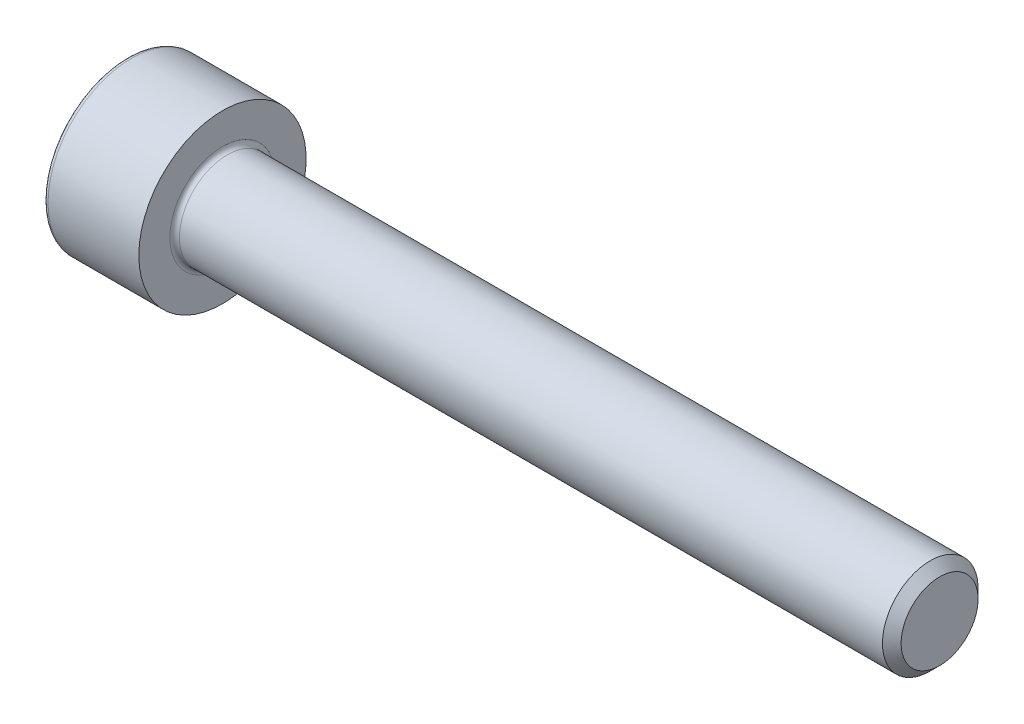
from build123d import *

# Parameters (mm, degrees)
FILLET1_R   = 0.2
FILLET2_R   = 0.2
HEX_2_DEPTH = 2


with BuildPart() as part:
    # BodySke → Base-Revolve (revolve)
    with BuildSketch(Plane.XY, mode=Mode.PRIVATE) as base_revolve_sk:
        Polygon((0, 0), (0, 3.5), (4, 3.5), (4, 2), (33.61, 2), (34, 1.61), (34, 0), align=None)
    revolve(base_revolve_sk.sketch.rotate(Axis((-31.75, 0, 0), (1, 0, 0)), 90), axis=Axis((-31.75, 0, 0), (1, 0, 0)))

    # Fillet1
    fillet1_edges = [part.edges().sort_by_distance(p)[0] for p in [
        (4, 0, -2),
    ]]
    fillet(fillet1_edges, radius=FILLET1_R)

    # Fillet2
    fillet2_edges = [part.edges().sort_by_distance(p)[0] for p in [
        (0, 0, -3.5),
    ]]
    fillet(fillet2_edges, radius=FILLET2_R)

    # Sketch2 → Hex-PreBroach (revolve, cut)
    with BuildSketch(Plane.XY, mode=Mode.PRIVATE) as hex_prebroach_sk:
        Polygon((0, 1.5355), (2, 1.5355), (2.886521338, 0), (0, 0), align=None)
    revolve(hex_prebroach_sk.sketch.rotate(Axis((0, 0, 0), (1, 0, 0)), 90), axis=Axis((0, 0, 0), (1, 0, 0)), mode=Mode.SUBTRACT)

    # Sketch3 → Hex 2 (cut)
    with BuildSketch(Plane(origin=(0, 0, 0), x_dir=(0, 0.500000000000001, 0.866025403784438), z_dir=(-1, 0, 0))):
        Polygon((0.886521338, 1.5355), (-0.886521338, 1.5355), (-1.773042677, 0), (-0.886521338, -1.5355), (0.886521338, -1.5355), (1.773042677, 0), align=None)
    extrude(amount=-HEX_2_DEPTH, mode=Mode.SUBTRACT)


solid = part.part
